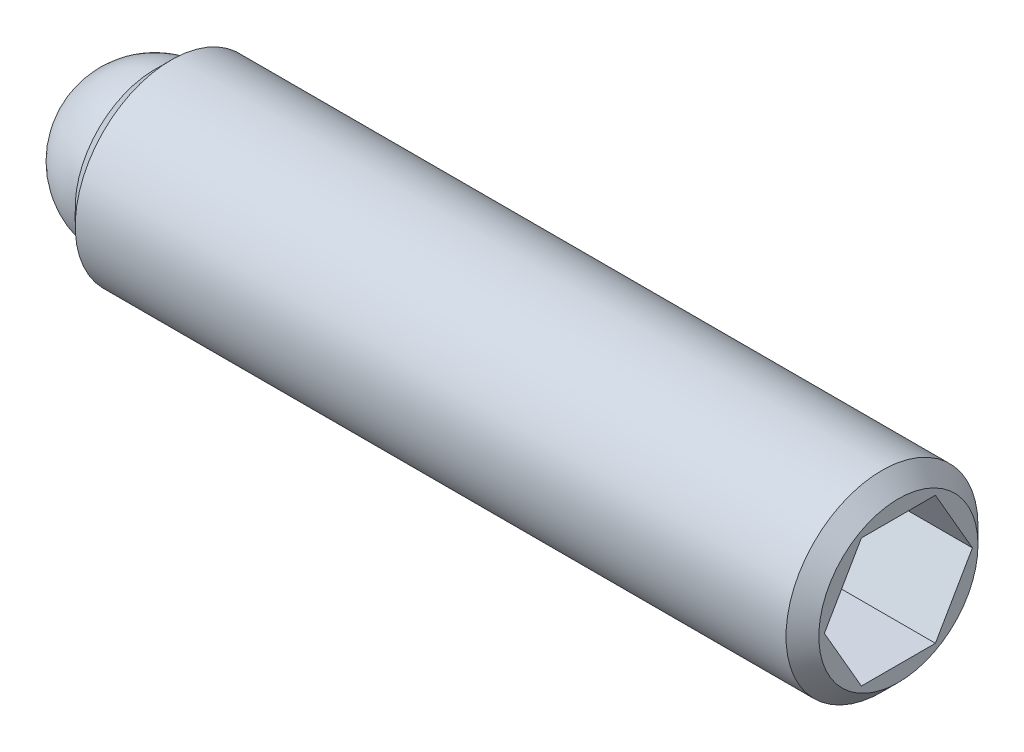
from build123d import *

# Parameters (mm, degrees)
SKETCH2_R           = 1.4859
BOSS_EXTRUDE1_DEPTH = 11.509375
CHAMFER1_SIZE       = 0.254
CHAMFER2_SIZE       = 0.254
CUT_EXTRUDE2_DEPTH  = 2.286
SKETCH3_R           = 1.190625
CUT_EXTRUDE3_DEPTH  = 1.190625


with BuildPart() as part:
    # Sketch2 → Boss-Extrude1 (new body)
    with BuildSketch(Plane(origin=(0, 0, 0), x_dir=(0, 0, -1), z_dir=(1, 0, 0))):
        Circle(SKETCH2_R)
    extrude(amount=BOSS_EXTRUDE1_DEPTH)

    # Chamfer1
    chamfer1_edges = [part.edges().sort_by_distance(p)[0] for p in [
        (0, 0, 1.4859),
    ]]
    chamfer(chamfer1_edges, length=CHAMFER1_SIZE)

    # Chamfer2
    chamfer2_edges = [part.edges().sort_by_distance(p)[0] for p in [
        (11.509375, 0, 1.4859),
    ]]
    chamfer(chamfer2_edges, length=CHAMFER2_SIZE)

    # Sketch4 → Cut-Extrude2 (cut)
    with BuildSketch(Plane(origin=(11.509375, 0, 0), x_dir=(0, 0, -1), z_dir=(1, 0, 0))):
        Polygon((1.14567944, 0), (0.57283972, 0.9921875), (-0.57283972, 0.9921875), (-1.14567944, 0), (-0.57283972, -0.9921875), (0.57283972, -0.9921875), align=None)
    extrude(amount=-CUT_EXTRUDE2_DEPTH, mode=Mode.SUBTRACT)

    # Sketch3 → Cut-Extrude3 (cut)
    with BuildSketch(Plane.ZY):
        Circle(SKETCH3_R)
    extrude(amount=-CUT_EXTRUDE3_DEPTH, mode=Mode.SUBTRACT)


with BuildPart() as body_2:
    # Sketch5 → Revolve1 (revolve)
    with BuildSketch(Plane.ZY):
        with BuildLine():
            Line((0, 0), (0, -1.190625))
            ThreePointArc((0, -1.190625), (-1.190625, 0), (0, 1.190625))
            Line((0, 1.190625), (0, 0))
        make_face()
    revolve(axis=Axis((0, 0, 0), (0, 1, 0)))


solid = Compound([part.part, body_2.part])
